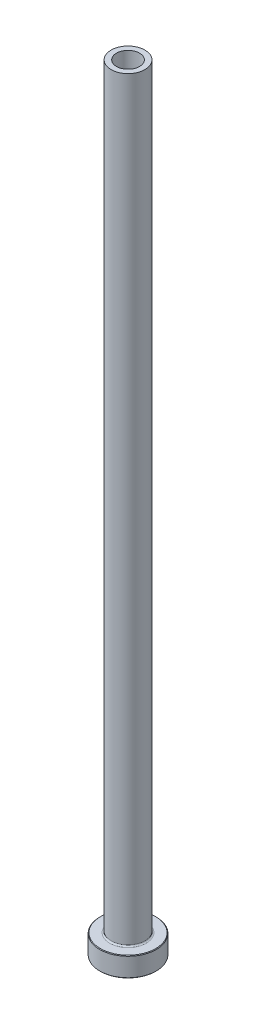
ISO-10303-21;
HEADER;
FILE_DESCRIPTION(('STEP AP214'),'2;1');
FILE_NAME('part.step','',(''),(''),'','','');
FILE_SCHEMA(('AUTOMOTIVE_DESIGN { 1 0 10303 214 1 1 1 1 }'));
ENDSEC;
DATA;
#1=APPLICATION_CONTEXT('core data for automotive mechanical design processes');
#2=APPLICATION_PROTOCOL_DEFINITION('international standard','automotive_design',2000,#1);
#3=PRODUCT_CONTEXT('',#1,'mechanical');
#4=PRODUCT('Part','Part','',(#3));
#5=PRODUCT_RELATED_PRODUCT_CATEGORY('part','',(#4));
#6=PRODUCT_DEFINITION_FORMATION('','',#4);
#7=PRODUCT_DEFINITION_CONTEXT('part definition',#1,'design');
#8=PRODUCT_DEFINITION('design','',#6,#7);
#9=PRODUCT_DEFINITION_SHAPE('','',#8);
#10=(LENGTH_UNIT() NAMED_UNIT(*) SI_UNIT(.MILLI.,.METRE.));
#11=(NAMED_UNIT(*) PLANE_ANGLE_UNIT() SI_UNIT($,.RADIAN.));
#12=(NAMED_UNIT(*) SI_UNIT($,.STERADIAN.) SOLID_ANGLE_UNIT());
#13=UNCERTAINTY_MEASURE_WITH_UNIT(LENGTH_MEASURE(1.E-05),#10,'distance_accuracy_value','');
#14=(GEOMETRIC_REPRESENTATION_CONTEXT(3) GLOBAL_UNCERTAINTY_ASSIGNED_CONTEXT((#13)) GLOBAL_UNIT_ASSIGNED_CONTEXT((#10,
#11,#12)) REPRESENTATION_CONTEXT('',''));
#15=CARTESIAN_POINT('',(0.,0.,0.));
#16=DIRECTION('',(0.,0.,1.));
#17=DIRECTION('',(1.,0.,0.));
#18=AXIS2_PLACEMENT_3D('',#15,#16,#17);
#19=CARTESIAN_POINT('',(0.,92.1876809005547,0.));
#20=DIRECTION('',(0.,1.,0.));
#21=DIRECTION('',(0.,0.,1.));
#22=AXIS2_PLACEMENT_3D('',#19,#20,#21);
#23=CYLINDRICAL_SURFACE('',#22,4.10000000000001);
#24=CARTESIAN_POINT('',(0.,275.,0.));
#25=DIRECTION('',(0.,1.,0.));
#26=DIRECTION('',(0.,0.,1.));
#27=AXIS2_PLACEMENT_3D('',#24,#25,#26);
#28=CIRCLE('',#27,4.10000000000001);
#29=CARTESIAN_POINT('',(0.,275.,4.10000000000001));
#30=VERTEX_POINT('',#29);
#31=EDGE_CURVE('E62',#30,#30,#28,.T.);
#32=ORIENTED_EDGE('',*,*,#31,.T.);
#33=EDGE_LOOP('',(#32));
#34=FACE_BOUND('',#33,.T.);
#35=CARTESIAN_POINT('',(0.,230.,0.));
#36=DIRECTION('',(0.,1.,0.));
#37=DIRECTION('',(0.,0.,1.));
#38=AXIS2_PLACEMENT_3D('',#35,#36,#37);
#39=CIRCLE('',#38,4.10000000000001);
#40=CARTESIAN_POINT('',(0.,230.,4.10000000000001));
#41=VERTEX_POINT('',#40);
#42=EDGE_CURVE('E71',#41,#41,#39,.T.);
#43=ORIENTED_EDGE('',*,*,#42,.F.);
#44=EDGE_LOOP('',(#43));
#45=FACE_BOUND('',#44,.T.);
#46=ADVANCED_FACE('F30',(#34,#45),#23,.F.);
#47=CARTESIAN_POINT('',(-4.10000000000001,275.,0.));
#48=DIRECTION('',(0.,1.,0.));
#49=DIRECTION('',(0.,0.,1.));
#50=AXIS2_PLACEMENT_3D('',#47,#48,#49);
#51=PLANE('',#50);
#52=CARTESIAN_POINT('',(0.,275.,0.));
#53=DIRECTION('',(0.,1.,0.));
#54=DIRECTION('',(0.,0.,1.));
#55=AXIS2_PLACEMENT_3D('',#52,#53,#54);
#56=CIRCLE('',#55,6.00000000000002);
#57=CARTESIAN_POINT('',(0.,275.,6.00000000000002));
#58=VERTEX_POINT('',#57);
#59=EDGE_CURVE('E65',#58,#58,#56,.T.);
#60=ORIENTED_EDGE('',*,*,#59,.T.);
#61=EDGE_LOOP('',(#60));
#62=FACE_BOUND('',#61,.T.);
#63=ORIENTED_EDGE('',*,*,#31,.F.);
#64=EDGE_LOOP('',(#63));
#65=FACE_BOUND('',#64,.T.);
#66=ADVANCED_FACE('F79',(#62,#65),#51,.T.);
#67=CARTESIAN_POINT('',(0.,92.1876809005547,0.));
#68=DIRECTION('',(0.,1.,0.));
#69=DIRECTION('',(0.,0.,1.));
#70=AXIS2_PLACEMENT_3D('',#67,#68,#69);
#71=CYLINDRICAL_SURFACE('',#70,6.00000000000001);
#72=CARTESIAN_POINT('',(0.,7.50000000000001,0.));
#73=DIRECTION('',(0.,1.,0.));
#74=DIRECTION('',(0.,0.,1.));
#75=AXIS2_PLACEMENT_3D('',#72,#73,#74);
#76=CIRCLE('',#75,6.00000000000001);
#77=CARTESIAN_POINT('',(0.,7.50000000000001,6.00000000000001));
#78=VERTEX_POINT('',#77);
#79=EDGE_CURVE('E59',#78,#78,#76,.T.);
#80=ORIENTED_EDGE('',*,*,#79,.T.);
#81=EDGE_LOOP('',(#80));
#82=FACE_BOUND('',#81,.T.);
#83=ORIENTED_EDGE('',*,*,#59,.F.);
#84=EDGE_LOOP('',(#83));
#85=FACE_BOUND('',#84,.T.);
#86=ADVANCED_FACE('F85',(#82,#85),#71,.T.);
#87=CARTESIAN_POINT('',(-5.99999999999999,7.,0.));
#88=DIRECTION('',(0.,1.,0.));
#89=DIRECTION('',(0.,0.,1.));
#90=AXIS2_PLACEMENT_3D('',#87,#88,#89);
#91=PLANE('',#90);
#92=CARTESIAN_POINT('',(0.,7.,0.));
#93=DIRECTION('',(0.,1.,0.));
#94=DIRECTION('',(0.,0.,1.));
#95=AXIS2_PLACEMENT_3D('',#92,#93,#94);
#96=CIRCLE('',#95,9.80000000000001);
#97=CARTESIAN_POINT('',(0.,7.,-9.80000000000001));
#98=VERTEX_POINT('',#97);
#99=EDGE_CURVE('E53',#98,#98,#96,.T.);
#100=ORIENTED_EDGE('',*,*,#99,.T.);
#101=EDGE_LOOP('',(#100));
#102=FACE_BOUND('',#101,.T.);
#103=CARTESIAN_POINT('',(0.,7.,0.));
#104=DIRECTION('',(0.,1.,0.));
#105=DIRECTION('',(0.,0.,1.));
#106=AXIS2_PLACEMENT_3D('',#103,#104,#105);
#107=CIRCLE('',#106,6.50000000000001);
#108=CARTESIAN_POINT('',(0.,7.,6.50000000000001));
#109=VERTEX_POINT('',#108);
#110=EDGE_CURVE('E56',#109,#109,#107,.F.);
#111=ORIENTED_EDGE('',*,*,#110,.T.);
#112=EDGE_LOOP('',(#111));
#113=FACE_BOUND('',#112,.T.);
#114=ADVANCED_FACE('F111',(#102,#113),#91,.T.);
#115=CARTESIAN_POINT('',(0.,92.1876809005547,0.));
#116=DIRECTION('',(0.,1.,0.));
#117=DIRECTION('',(0.,0.,1.));
#118=AXIS2_PLACEMENT_3D('',#115,#116,#117);
#119=CYLINDRICAL_SURFACE('',#118,9.99999999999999);
#120=CARTESIAN_POINT('',(0.,6.80000000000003,0.));
#121=DIRECTION('',(0.,1.,0.));
#122=DIRECTION('',(0.,0.,1.));
#123=AXIS2_PLACEMENT_3D('',#120,#121,#122);
#124=CIRCLE('',#123,9.99999999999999);
#125=CARTESIAN_POINT('',(0.,6.80000000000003,-9.99999999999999));
#126=VERTEX_POINT('',#125);
#127=EDGE_CURVE('E45',#126,#126,#124,.F.);
#128=ORIENTED_EDGE('',*,*,#127,.T.);
#129=EDGE_LOOP('',(#128));
#130=FACE_BOUND('',#129,.T.);
#131=CARTESIAN_POINT('',(0.,0.200000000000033,0.));
#132=DIRECTION('',(0.,-1.,0.));
#133=DIRECTION('',(0.,0.,-1.));
#134=AXIS2_PLACEMENT_3D('',#131,#132,#133);
#135=CIRCLE('',#134,9.99999999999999);
#136=CARTESIAN_POINT('',(0.,0.200000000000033,-9.99999999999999));
#137=VERTEX_POINT('',#136);
#138=EDGE_CURVE('E50',#137,#137,#135,.F.);
#139=ORIENTED_EDGE('',*,*,#138,.T.);
#140=EDGE_LOOP('',(#139));
#141=FACE_BOUND('',#140,.T.);
#142=ADVANCED_FACE('F108',(#130,#141),#119,.T.);
#143=CARTESIAN_POINT('',(-9.99999999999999,0.,0.));
#144=DIRECTION('',(0.,-1.,0.));
#145=DIRECTION('',(0.,0.,-1.));
#146=AXIS2_PLACEMENT_3D('',#143,#144,#145);
#147=PLANE('',#146);
#148=CARTESIAN_POINT('',(0.,0.,0.));
#149=DIRECTION('',(0.,-1.,0.));
#150=DIRECTION('',(0.,0.,-1.));
#151=AXIS2_PLACEMENT_3D('',#148,#149,#150);
#152=CIRCLE('',#151,4.85000000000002);
#153=CARTESIAN_POINT('',(0.,0.,-4.85000000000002));
#154=VERTEX_POINT('',#153);
#155=EDGE_CURVE('E37',#154,#154,#152,.F.);
#156=ORIENTED_EDGE('',*,*,#155,.T.);
#157=EDGE_LOOP('',(#156));
#158=FACE_BOUND('',#157,.T.);
#159=CARTESIAN_POINT('',(0.,0.,0.));
#160=DIRECTION('',(0.,-1.,0.));
#161=DIRECTION('',(0.,0.,-1.));
#162=AXIS2_PLACEMENT_3D('',#159,#160,#161);
#163=CIRCLE('',#162,9.79999999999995);
#164=CARTESIAN_POINT('',(0.,0.,-9.79999999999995));
#165=VERTEX_POINT('',#164);
#166=EDGE_CURVE('E41',#165,#165,#163,.T.);
#167=ORIENTED_EDGE('',*,*,#166,.T.);
#168=EDGE_LOOP('',(#167));
#169=FACE_BOUND('',#168,.T.);
#170=ADVANCED_FACE('F110',(#158,#169),#147,.T.);
#171=CARTESIAN_POINT('',(0.,92.1876809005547,0.));
#172=DIRECTION('',(0.,1.,0.));
#173=DIRECTION('',(0.,0.,1.));
#174=AXIS2_PLACEMENT_3D('',#171,#172,#173);
#175=CYLINDRICAL_SURFACE('',#174,4.35);
#176=CARTESIAN_POINT('',(0.,0.500000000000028,0.));
#177=DIRECTION('',(0.,-1.,0.));
#178=DIRECTION('',(0.,0.,-1.));
#179=AXIS2_PLACEMENT_3D('',#176,#177,#178);
#180=CIRCLE('',#179,4.35);
#181=CARTESIAN_POINT('',(0.,0.500000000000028,-4.35));
#182=VERTEX_POINT('',#181);
#183=EDGE_CURVE('E10',#182,#182,#180,.T.);
#184=ORIENTED_EDGE('',*,*,#183,.T.);
#185=EDGE_LOOP('',(#184));
#186=FACE_BOUND('',#185,.T.);
#187=CARTESIAN_POINT('',(0.,218.,0.));
#188=DIRECTION('',(0.,1.,0.));
#189=DIRECTION('',(0.,0.,1.));
#190=AXIS2_PLACEMENT_3D('',#187,#188,#189);
#191=CIRCLE('',#190,4.35000000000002);
#192=CARTESIAN_POINT('',(0.,218.,4.35000000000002));
#193=VERTEX_POINT('',#192);
#194=EDGE_CURVE('E68',#193,#193,#191,.T.);
#195=ORIENTED_EDGE('',*,*,#194,.T.);
#196=EDGE_LOOP('',(#195));
#197=FACE_BOUND('',#196,.T.);
#198=ADVANCED_FACE('F118',(#186,#197),#175,.F.);
#199=CARTESIAN_POINT('',(0.,218.,0.));
#200=DIRECTION('',(0.,-1.,0.));
#201=DIRECTION('',(0.,0.,-1.));
#202=AXIS2_PLACEMENT_3D('',#199,#200,#201);
#203=CONICAL_SURFACE('',#202,4.35000000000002,0.0208303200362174);
#204=ORIENTED_EDGE('',*,*,#42,.T.);
#205=EDGE_LOOP('',(#204));
#206=FACE_BOUND('',#205,.T.);
#207=ORIENTED_EDGE('',*,*,#194,.F.);
#208=EDGE_LOOP('',(#207));
#209=FACE_BOUND('',#208,.T.);
#210=ADVANCED_FACE('F75',(#206,#209),#203,.F.);
#211=CARTESIAN_POINT('',(0.,7.50000000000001,0.));
#212=DIRECTION('',(0.,1.,0.));
#213=DIRECTION('',(0.,0.,1.));
#214=AXIS2_PLACEMENT_3D('',#211,#212,#213);
#215=TOROIDAL_SURFACE('',#214,6.50000000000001,0.5);
#216=ORIENTED_EDGE('',*,*,#110,.F.);
#217=EDGE_LOOP('',(#216));
#218=FACE_BOUND('',#217,.T.);
#219=ORIENTED_EDGE('',*,*,#79,.F.);
#220=EDGE_LOOP('',(#219));
#221=FACE_BOUND('',#220,.T.);
#222=ADVANCED_FACE('F90',(#218,#221),#215,.F.);
#223=CARTESIAN_POINT('',(0.,7.00000000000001,0.));
#224=DIRECTION('',(0.,-1.,0.));
#225=DIRECTION('',(0.,0.,-1.));
#226=AXIS2_PLACEMENT_3D('',#223,#224,#225);
#227=CONICAL_SURFACE('',#226,9.8,0.785398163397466);
#228=CARTESIAN_POINT('',(0.,6.80000000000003,-9.99999999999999));
#229=CARTESIAN_POINT('',(0.,6.80208333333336,-9.99791666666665));
#230=CARTESIAN_POINT('',(0.,6.80416666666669,-9.99583333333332));
#231=CARTESIAN_POINT('',(0.,6.80833333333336,-9.99166666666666));
#232=CARTESIAN_POINT('',(0.,6.81041666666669,-9.98958333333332));
#233=CARTESIAN_POINT('',(0.,6.81458333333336,-9.98541666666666));
#234=CARTESIAN_POINT('',(0.,6.81666666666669,-9.98333333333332));
#235=CARTESIAN_POINT('',(0.,6.82083333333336,-9.97916666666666));
#236=CARTESIAN_POINT('',(0.,6.82291666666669,-9.97708333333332));
#237=CARTESIAN_POINT('',(0.,6.82708333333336,-9.97291666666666));
#238=CARTESIAN_POINT('',(0.,6.82916666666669,-9.97083333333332));
#239=CARTESIAN_POINT('',(0.,6.83333333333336,-9.96666666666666));
#240=CARTESIAN_POINT('',(0.,6.83541666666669,-9.96458333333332));
#241=CARTESIAN_POINT('',(0.,6.83958333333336,-9.96041666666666));
#242=CARTESIAN_POINT('',(0.,6.84166666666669,-9.95833333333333));
#243=CARTESIAN_POINT('',(0.,6.84583333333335,-9.95416666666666));
#244=CARTESIAN_POINT('',(0.,6.84791666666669,-9.95208333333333));
#245=CARTESIAN_POINT('',(0.,6.85208333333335,-9.94791666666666));
#246=CARTESIAN_POINT('',(0.,6.85416666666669,-9.94583333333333));
#247=CARTESIAN_POINT('',(0.,6.85833333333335,-9.94166666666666));
#248=CARTESIAN_POINT('',(0.,6.86041666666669,-9.93958333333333));
#249=CARTESIAN_POINT('',(0.,6.86458333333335,-9.93541666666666));
#250=CARTESIAN_POINT('',(0.,6.86666666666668,-9.93333333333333));
#251=CARTESIAN_POINT('',(0.,6.87083333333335,-9.92916666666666));
#252=CARTESIAN_POINT('',(0.,6.87291666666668,-9.92708333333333));
#253=CARTESIAN_POINT('',(0.,6.87708333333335,-9.92291666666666));
#254=CARTESIAN_POINT('',(0.,6.87916666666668,-9.92083333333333));
#255=CARTESIAN_POINT('',(0.,6.88333333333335,-9.91666666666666));
#256=CARTESIAN_POINT('',(0.,6.88541666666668,-9.91458333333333));
#257=CARTESIAN_POINT('',(0.,6.88958333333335,-9.91041666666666));
#258=CARTESIAN_POINT('',(0.,6.89166666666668,-9.90833333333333));
#259=CARTESIAN_POINT('',(0.,6.89583333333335,-9.90416666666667));
#260=CARTESIAN_POINT('',(0.,6.89791666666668,-9.90208333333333));
#261=CARTESIAN_POINT('',(0.,6.90208333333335,-9.89791666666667));
#262=CARTESIAN_POINT('',(0.,6.90416666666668,-9.89583333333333));
#263=CARTESIAN_POINT('',(0.,6.90833333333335,-9.89166666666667));
#264=CARTESIAN_POINT('',(0.,6.91041666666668,-9.88958333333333));
#265=CARTESIAN_POINT('',(0.,6.91458333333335,-9.88541666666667));
#266=CARTESIAN_POINT('',(0.,6.91666666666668,-9.88333333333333));
#267=CARTESIAN_POINT('',(0.,6.92083333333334,-9.87916666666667));
#268=CARTESIAN_POINT('',(0.,6.92291666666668,-9.87708333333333));
#269=CARTESIAN_POINT('',(0.,6.92708333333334,-9.87291666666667));
#270=CARTESIAN_POINT('',(0.,6.92916666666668,-9.87083333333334));
#271=CARTESIAN_POINT('',(0.,6.93333333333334,-9.86666666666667));
#272=CARTESIAN_POINT('',(0.,6.93541666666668,-9.86458333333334));
#273=CARTESIAN_POINT('',(0.,6.93958333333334,-9.86041666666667));
#274=CARTESIAN_POINT('',(0.,6.94166666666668,-9.85833333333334));
#275=CARTESIAN_POINT('',(0.,6.94583333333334,-9.85416666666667));
#276=CARTESIAN_POINT('',(0.,6.94791666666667,-9.85208333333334));
#277=CARTESIAN_POINT('',(0.,6.95208333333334,-9.84791666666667));
#278=CARTESIAN_POINT('',(0.,6.95416666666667,-9.84583333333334));
#279=CARTESIAN_POINT('',(0.,6.95833333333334,-9.84166666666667));
#280=CARTESIAN_POINT('',(0.,6.96041666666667,-9.83958333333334));
#281=CARTESIAN_POINT('',(0.,6.96458333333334,-9.83541666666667));
#282=CARTESIAN_POINT('',(0.,6.96666666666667,-9.83333333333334));
#283=CARTESIAN_POINT('',(0.,6.97083333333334,-9.82916666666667));
#284=CARTESIAN_POINT('',(0.,6.97291666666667,-9.82708333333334));
#285=CARTESIAN_POINT('',(0.,6.97708333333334,-9.82291666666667));
#286=CARTESIAN_POINT('',(0.,6.97916666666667,-9.82083333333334));
#287=CARTESIAN_POINT('',(0.,6.98333333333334,-9.81666666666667));
#288=CARTESIAN_POINT('',(0.,6.98541666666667,-9.81458333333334));
#289=CARTESIAN_POINT('',(0.,6.98958333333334,-9.81041666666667));
#290=CARTESIAN_POINT('',(0.,6.99166666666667,-9.80833333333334));
#291=CARTESIAN_POINT('',(0.,6.99583333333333,-9.80416666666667));
#292=CARTESIAN_POINT('',(0.,6.99791666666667,-9.80208333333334));
#293=CARTESIAN_POINT('',(0.,7.,-9.80000000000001));
#294=B_SPLINE_CURVE_WITH_KNOTS('',3,(#228,#229,#230,#231,#232,#233,#234,#235,#236,#237,#238,
#239,#240,#241,#242,#243,#244,#245,#246,#247,#248,#249,#250,#251,#252,#253,#254,#255,#256,#257,
#258,#259,#260,#261,#262,#263,#264,#265,#266,#267,#268,#269,#270,#271,#272,#273,#274,#275,#276,
#277,#278,#279,#280,#281,#282,#283,#284,#285,#286,#287,#288,#289,#290,#291,#292,#293),
.UNSPECIFIED.,.F.,.F.,(4,2,2,2,2,2,2,2,2,2,2,2,2,2,2,2,2,2,2,2,2,2,2,2,2,2,2,2,2,2,2,2,4),(0.,
0.00883883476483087,0.0176776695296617,0.0265165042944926,0.0353553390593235,0.0441941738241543,
0.0530330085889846,0.0618718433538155,0.0707106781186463,0.0795495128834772,0.0883883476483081,
0.0972271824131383,0.106066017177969,0.1149048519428,0.123743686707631,0.132582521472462,
0.141421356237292,0.150260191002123,0.159099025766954,0.167937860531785,0.176776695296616,
0.185615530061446,0.194454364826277,0.203293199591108,0.212132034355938,0.220970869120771,
0.229809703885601,0.238648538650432,0.247487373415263,0.256326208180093,0.265165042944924,
0.274003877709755,0.282842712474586),.UNSPECIFIED.);
#295=EDGE_CURVE('BSEAM93',#126,#98,#294,.T.);
#296=ORIENTED_EDGE('',*,*,#127,.F.);
#297=ORIENTED_EDGE('',*,*,#99,.F.);
#298=ORIENTED_EDGE('',*,*,#295,.T.);
#299=ORIENTED_EDGE('',*,*,#295,.F.);
#300=EDGE_LOOP('',(#296,#298,#297,#299));
#301=FACE_BOUND('',#300,.T.);
#302=ADVANCED_FACE('F93',(#301),#227,.T.);
#303=CARTESIAN_POINT('',(0.,0.200000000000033,0.));
#304=DIRECTION('',(0.,1.,0.));
#305=DIRECTION('',(0.,0.,1.));
#306=AXIS2_PLACEMENT_3D('',#303,#304,#305);
#307=CONICAL_SURFACE('',#306,9.99999999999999,0.785398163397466);
#308=ORIENTED_EDGE('',*,*,#166,.F.);
#309=EDGE_LOOP('',(#308));
#310=FACE_BOUND('',#309,.T.);
#311=ORIENTED_EDGE('',*,*,#138,.F.);
#312=EDGE_LOOP('',(#311));
#313=FACE_BOUND('',#312,.T.);
#314=ADVANCED_FACE('F96',(#310,#313),#307,.T.);
#315=CARTESIAN_POINT('',(0.,0.,0.));
#316=DIRECTION('',(0.,-1.,0.));
#317=DIRECTION('',(0.,0.,-1.));
#318=AXIS2_PLACEMENT_3D('',#315,#316,#317);
#319=CONICAL_SURFACE('',#318,4.85000000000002,0.785398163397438);
#320=ORIENTED_EDGE('',*,*,#183,.F.);
#321=EDGE_LOOP('',(#320));
#322=FACE_BOUND('',#321,.T.);
#323=ORIENTED_EDGE('',*,*,#155,.F.);
#324=EDGE_LOOP('',(#323));
#325=FACE_BOUND('',#324,.T.);
#326=ADVANCED_FACE('F32',(#322,#325),#319,.F.);
#327=CLOSED_SHELL('',(#46,#66,#86,#114,#142,#170,#198,#210,#222,#302,#314,#326));
#328=MANIFOLD_SOLID_BREP('B2',#327);
#329=ADVANCED_BREP_SHAPE_REPRESENTATION('',(#18,#328),#14);
#330=SHAPE_DEFINITION_REPRESENTATION(#9,#329);
ENDSEC;
END-ISO-10303-21;
